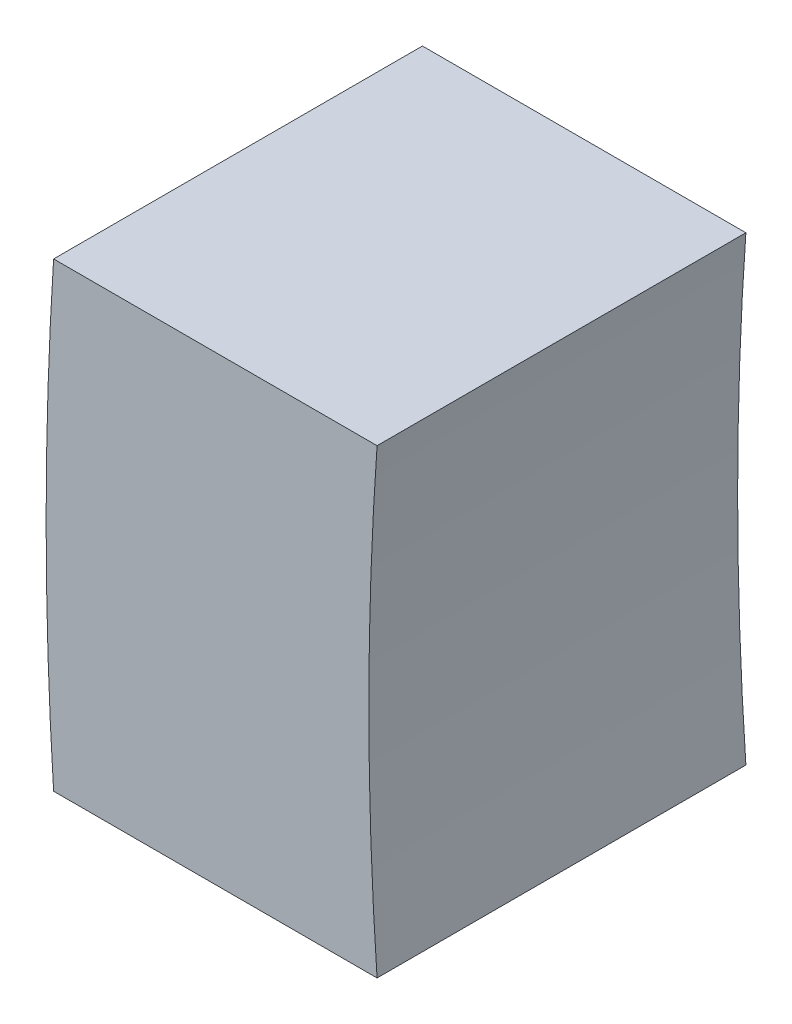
ISO-10303-21;
HEADER;
FILE_DESCRIPTION(('STEP AP214'),'2;1');
FILE_NAME('part.step','',(''),(''),'','','');
FILE_SCHEMA(('AUTOMOTIVE_DESIGN { 1 0 10303 214 1 1 1 1 }'));
ENDSEC;
DATA;
#1=APPLICATION_CONTEXT('core data for automotive mechanical design processes');
#2=APPLICATION_PROTOCOL_DEFINITION('international standard','automotive_design',2000,#1);
#3=PRODUCT_CONTEXT('',#1,'mechanical');
#4=PRODUCT('Part','Part','',(#3));
#5=PRODUCT_RELATED_PRODUCT_CATEGORY('part','',(#4));
#6=PRODUCT_DEFINITION_FORMATION('','',#4);
#7=PRODUCT_DEFINITION_CONTEXT('part definition',#1,'design');
#8=PRODUCT_DEFINITION('design','',#6,#7);
#9=PRODUCT_DEFINITION_SHAPE('','',#8);
#10=(LENGTH_UNIT() NAMED_UNIT(*) SI_UNIT(.MILLI.,.METRE.));
#11=(NAMED_UNIT(*) PLANE_ANGLE_UNIT() SI_UNIT($,.RADIAN.));
#12=(NAMED_UNIT(*) SI_UNIT($,.STERADIAN.) SOLID_ANGLE_UNIT());
#13=UNCERTAINTY_MEASURE_WITH_UNIT(LENGTH_MEASURE(1.E-05),#10,'distance_accuracy_value','');
#14=(GEOMETRIC_REPRESENTATION_CONTEXT(3) GLOBAL_UNCERTAINTY_ASSIGNED_CONTEXT((#13)) GLOBAL_UNIT_ASSIGNED_CONTEXT((#10,
#11,#12)) REPRESENTATION_CONTEXT('',''));
#15=CARTESIAN_POINT('',(0.,0.,0.));
#16=DIRECTION('',(0.,0.,1.));
#17=DIRECTION('',(1.,0.,0.));
#18=AXIS2_PLACEMENT_3D('',#15,#16,#17);
#19=CARTESIAN_POINT('',(0.,0.,8.00000000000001));
#20=DIRECTION('',(0.,0.,-1.));
#21=DIRECTION('',(-1.,0.,0.));
#22=AXIS2_PLACEMENT_3D('',#19,#20,#21);
#23=CYLINDRICAL_SURFACE('',#22,77.);
#24=CARTESIAN_POINT('',(0.,0.,0.));
#25=DIRECTION('',(0.,0.,1.));
#26=DIRECTION('',(1.,0.,0.));
#27=AXIS2_PLACEMENT_3D('',#24,#25,#26);
#28=CIRCLE('',#27,77.);
#29=CARTESIAN_POINT('',(-76.8374908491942,5.00000000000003,0.));
#30=VERTEX_POINT('',#29);
#31=CARTESIAN_POINT('',(-76.8374908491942,-4.99999999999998,0.));
#32=VERTEX_POINT('',#31);
#33=EDGE_CURVE('E74',#30,#32,#28,.T.);
#34=ORIENTED_EDGE('',*,*,#33,.T.);
#35=DIRECTION('',(0.,0.,-1.));
#36=VECTOR('',#35,1.);
#37=CARTESIAN_POINT('',(-76.8374908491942,-4.99999999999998,8.00000000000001));
#38=LINE('',#37,#36);
#39=CARTESIAN_POINT('',(-76.8374908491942,-4.99999999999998,8.00000000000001));
#40=VERTEX_POINT('',#39);
#41=EDGE_CURVE('E11',#40,#32,#38,.T.);
#42=ORIENTED_EDGE('',*,*,#41,.F.);
#43=CARTESIAN_POINT('',(0.,0.,8.00000000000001));
#44=DIRECTION('',(0.,0.,1.));
#45=DIRECTION('',(1.,0.,0.));
#46=AXIS2_PLACEMENT_3D('',#43,#44,#45);
#47=CIRCLE('',#46,77.);
#48=CARTESIAN_POINT('',(-76.8374908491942,5.00000000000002,8.00000000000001));
#49=VERTEX_POINT('',#48);
#50=EDGE_CURVE('E92',#49,#40,#47,.T.);
#51=ORIENTED_EDGE('',*,*,#50,.F.);
#52=DIRECTION('',(0.,0.,-1.));
#53=VECTOR('',#52,1.);
#54=CARTESIAN_POINT('',(-76.8374908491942,5.00000000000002,8.00000000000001));
#55=LINE('',#54,#53);
#56=EDGE_CURVE('E86',#49,#30,#55,.T.);
#57=ORIENTED_EDGE('',*,*,#56,.T.);
#58=EDGE_LOOP('',(#34,#42,#51,#57));
#59=FACE_BOUND('',#58,.T.);
#60=ADVANCED_FACE('F30',(#59),#23,.T.);
#61=CARTESIAN_POINT('',(-76.8374908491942,-4.99999999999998,8.00000000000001));
#62=DIRECTION('',(0.,1.,0.));
#63=DIRECTION('',(0.,0.,1.));
#64=AXIS2_PLACEMENT_3D('',#61,#62,#63);
#65=PLANE('',#64);
#66=DIRECTION('',(1.,0.,0.));
#67=VECTOR('',#66,1.);
#68=CARTESIAN_POINT('',(-76.8374908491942,-4.99999999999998,0.));
#69=LINE('',#68,#67);
#70=CARTESIAN_POINT('',(-69.8212002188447,-4.99999999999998,0.));
#71=VERTEX_POINT('',#70);
#72=EDGE_CURVE('E70',#32,#71,#69,.T.);
#73=ORIENTED_EDGE('',*,*,#72,.T.);
#74=DIRECTION('',(0.,0.,-1.));
#75=VECTOR('',#74,1.);
#76=CARTESIAN_POINT('',(-69.8212002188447,-4.99999999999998,8.));
#77=LINE('',#76,#75);
#78=CARTESIAN_POINT('',(-69.8212002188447,-4.99999999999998,8.));
#79=VERTEX_POINT('',#78);
#80=EDGE_CURVE('E37',#79,#71,#77,.T.);
#81=ORIENTED_EDGE('',*,*,#80,.F.);
#82=DIRECTION('',(1.,0.,0.));
#83=VECTOR('',#82,1.);
#84=CARTESIAN_POINT('',(-76.8374908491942,-4.99999999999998,8.00000000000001));
#85=LINE('',#84,#83);
#86=EDGE_CURVE('E82',#40,#79,#85,.T.);
#87=ORIENTED_EDGE('',*,*,#86,.F.);
#88=ORIENTED_EDGE('',*,*,#41,.T.);
#89=EDGE_LOOP('',(#73,#81,#87,#88));
#90=FACE_BOUND('',#89,.T.);
#91=ADVANCED_FACE('F81',(#90),#65,.F.);
#92=CARTESIAN_POINT('',(0.,0.,8.00000000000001));
#93=DIRECTION('',(0.,0.,-1.));
#94=DIRECTION('',(-1.,0.,0.));
#95=AXIS2_PLACEMENT_3D('',#92,#93,#94);
#96=CYLINDRICAL_SURFACE('',#95,70.);
#97=CARTESIAN_POINT('',(0.,0.,0.));
#98=DIRECTION('',(0.,0.,-1.));
#99=DIRECTION('',(1.,0.,0.));
#100=AXIS2_PLACEMENT_3D('',#97,#98,#99);
#101=CIRCLE('',#100,70.);
#102=CARTESIAN_POINT('',(-69.8212002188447,5.00000000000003,0.));
#103=VERTEX_POINT('',#102);
#104=EDGE_CURVE('E75',#71,#103,#101,.T.);
#105=ORIENTED_EDGE('',*,*,#104,.T.);
#106=DIRECTION('',(0.,0.,-1.));
#107=VECTOR('',#106,1.);
#108=CARTESIAN_POINT('',(-69.8212002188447,5.00000000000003,8.));
#109=LINE('',#108,#107);
#110=CARTESIAN_POINT('',(-69.8212002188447,5.00000000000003,8.));
#111=VERTEX_POINT('',#110);
#112=EDGE_CURVE('E98',#111,#103,#109,.T.);
#113=ORIENTED_EDGE('',*,*,#112,.F.);
#114=CARTESIAN_POINT('',(0.,0.,8.00000000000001));
#115=DIRECTION('',(0.,0.,-1.));
#116=DIRECTION('',(1.,0.,0.));
#117=AXIS2_PLACEMENT_3D('',#114,#115,#116);
#118=CIRCLE('',#117,70.);
#119=EDGE_CURVE('E49',#79,#111,#118,.T.);
#120=ORIENTED_EDGE('',*,*,#119,.F.);
#121=ORIENTED_EDGE('',*,*,#80,.T.);
#122=EDGE_LOOP('',(#105,#113,#120,#121));
#123=FACE_BOUND('',#122,.T.);
#124=ADVANCED_FACE('F101',(#123),#96,.F.);
#125=CARTESIAN_POINT('',(-76.8374908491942,5.00000000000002,8.00000000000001));
#126=DIRECTION('',(0.,-1.,0.));
#127=DIRECTION('',(0.,0.,-1.));
#128=AXIS2_PLACEMENT_3D('',#125,#126,#127);
#129=PLANE('',#128);
#130=DIRECTION('',(-1.,0.,0.));
#131=VECTOR('',#130,1.);
#132=CARTESIAN_POINT('',(-76.8374908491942,5.00000000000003,0.));
#133=LINE('',#132,#131);
#134=EDGE_CURVE('E90',#103,#30,#133,.T.);
#135=ORIENTED_EDGE('',*,*,#134,.T.);
#136=ORIENTED_EDGE('',*,*,#56,.F.);
#137=DIRECTION('',(-1.,0.,0.));
#138=VECTOR('',#137,1.);
#139=CARTESIAN_POINT('',(-76.8374908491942,5.00000000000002,8.00000000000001));
#140=LINE('',#139,#138);
#141=EDGE_CURVE('E44',#111,#49,#140,.T.);
#142=ORIENTED_EDGE('',*,*,#141,.F.);
#143=ORIENTED_EDGE('',*,*,#112,.T.);
#144=EDGE_LOOP('',(#135,#136,#142,#143));
#145=FACE_BOUND('',#144,.T.);
#146=ADVANCED_FACE('F103',(#145),#129,.F.);
#147=CARTESIAN_POINT('',(0.,0.,8.00000000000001));
#148=DIRECTION('',(0.,0.,1.));
#149=DIRECTION('',(1.,0.,0.));
#150=AXIS2_PLACEMENT_3D('',#147,#148,#149);
#151=PLANE('',#150);
#152=ORIENTED_EDGE('',*,*,#50,.T.);
#153=ORIENTED_EDGE('',*,*,#86,.T.);
#154=ORIENTED_EDGE('',*,*,#119,.T.);
#155=ORIENTED_EDGE('',*,*,#141,.T.);
#156=EDGE_LOOP('',(#152,#153,#154,#155));
#157=FACE_BOUND('',#156,.T.);
#158=ADVANCED_FACE('F104',(#157),#151,.T.);
#159=CARTESIAN_POINT('',(0.,0.,0.));
#160=DIRECTION('',(0.,0.,1.));
#161=DIRECTION('',(1.,0.,0.));
#162=AXIS2_PLACEMENT_3D('',#159,#160,#161);
#163=PLANE('',#162);
#164=ORIENTED_EDGE('',*,*,#33,.F.);
#165=ORIENTED_EDGE('',*,*,#134,.F.);
#166=ORIENTED_EDGE('',*,*,#104,.F.);
#167=ORIENTED_EDGE('',*,*,#72,.F.);
#168=EDGE_LOOP('',(#164,#165,#166,#167));
#169=FACE_BOUND('',#168,.T.);
#170=ADVANCED_FACE('F71',(#169),#163,.F.);
#171=CLOSED_SHELL('',(#60,#91,#124,#146,#158,#170));
#172=MANIFOLD_SOLID_BREP('B2',#171);
#173=ADVANCED_BREP_SHAPE_REPRESENTATION('',(#18,#172),#14);
#174=SHAPE_DEFINITION_REPRESENTATION(#9,#173);
ENDSEC;
END-ISO-10303-21;
